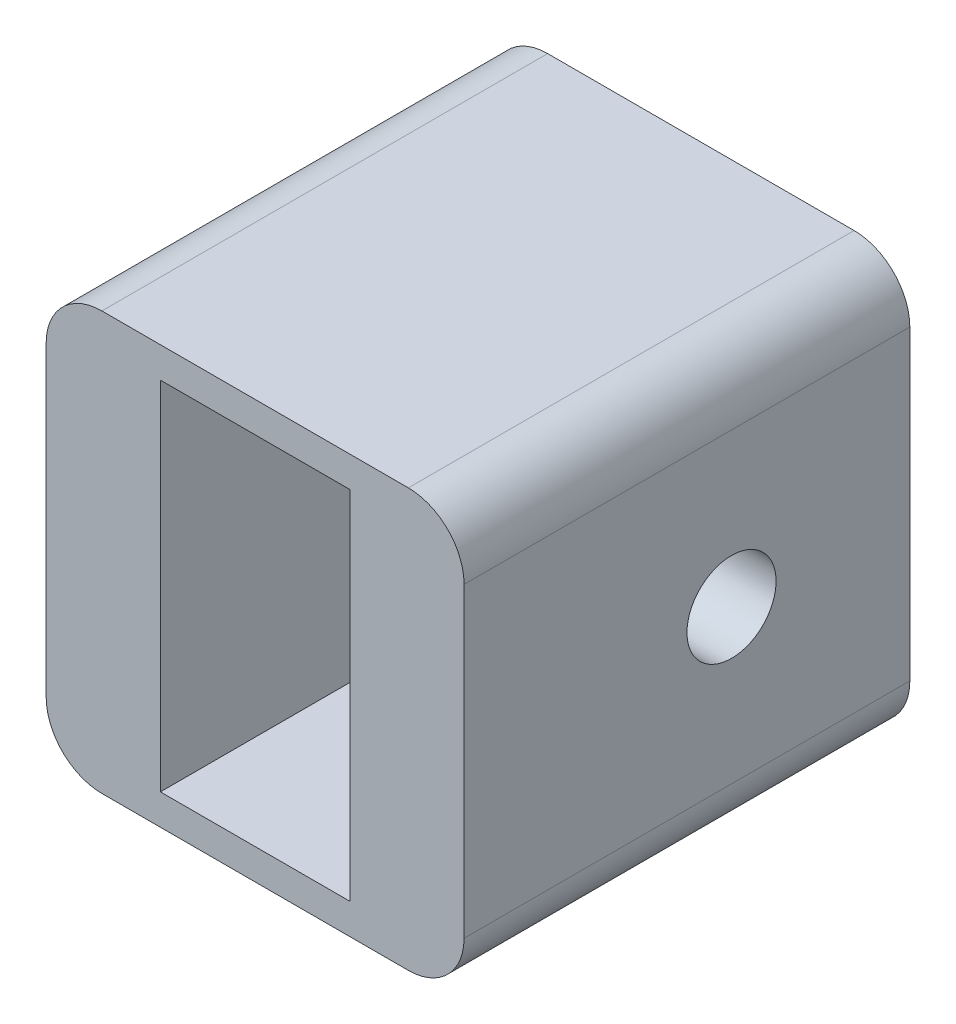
from build123d import *

# Parameters (mm, degrees)
BASE_EXTRUSION_DEPTH    = 80
ESQUISSE2_R             = 8
ENL_V_MAT_EXTRU_1_DEPTH = 116.893269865
ESQUISSE3_W             = 34
ESQUISSE3_H             = 64
ENL_V_MAT_EXTRU_2_DEPTH = 96.981769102


with BuildPart() as part:
    # Esquisse1 → Base-Extrusion (new body)
    with BuildSketch(Plane.XY):
        with BuildLine():
            Line((-27.5, 37.5), (27.5, 37.5))
            ThreePointArc((27.5, 37.5), (34.571067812, 34.571067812), (37.5, 27.5))
            Line((37.5, 27.5), (37.5, -27.5))
            ThreePointArc((37.5, -27.5), (34.571067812, -34.571067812), (27.5, -37.5))
            Line((27.5, -37.5), (-27.5, -37.5))
            ThreePointArc((-27.5, -37.5), (-34.571067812, -34.571067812), (-37.5, -27.5))
            Line((-37.5, -27.5), (-37.5, 27.5))
            ThreePointArc((-37.5, 27.5), (-34.571067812, 34.571067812), (-27.5, 37.5))
        make_face()
    extrude(amount=BASE_EXTRUSION_DEPTH)

    # Esquisse2 → Enl_v. mat.-Extru.1 (cut, through all)
    with BuildSketch(Plane(origin=(37.5, 0, 0), x_dir=(0, 0, -1), z_dir=(1, 0, 0))):
        with Locations(Location((-32, 0, 0), (0, 0, 90))):
            Circle(ESQUISSE2_R)
    extrude(amount=-ENL_V_MAT_EXTRU_1_DEPTH, mode=Mode.SUBTRACT)

    # Esquisse3 → Enl_v. mat.-Extru.2 (cut, through all)
    with BuildSketch(Plane.XY.offset(80)):
        Rectangle(ESQUISSE3_W, ESQUISSE3_H)
    extrude(amount=-ENL_V_MAT_EXTRU_2_DEPTH, mode=Mode.SUBTRACT)


solid = part.part
